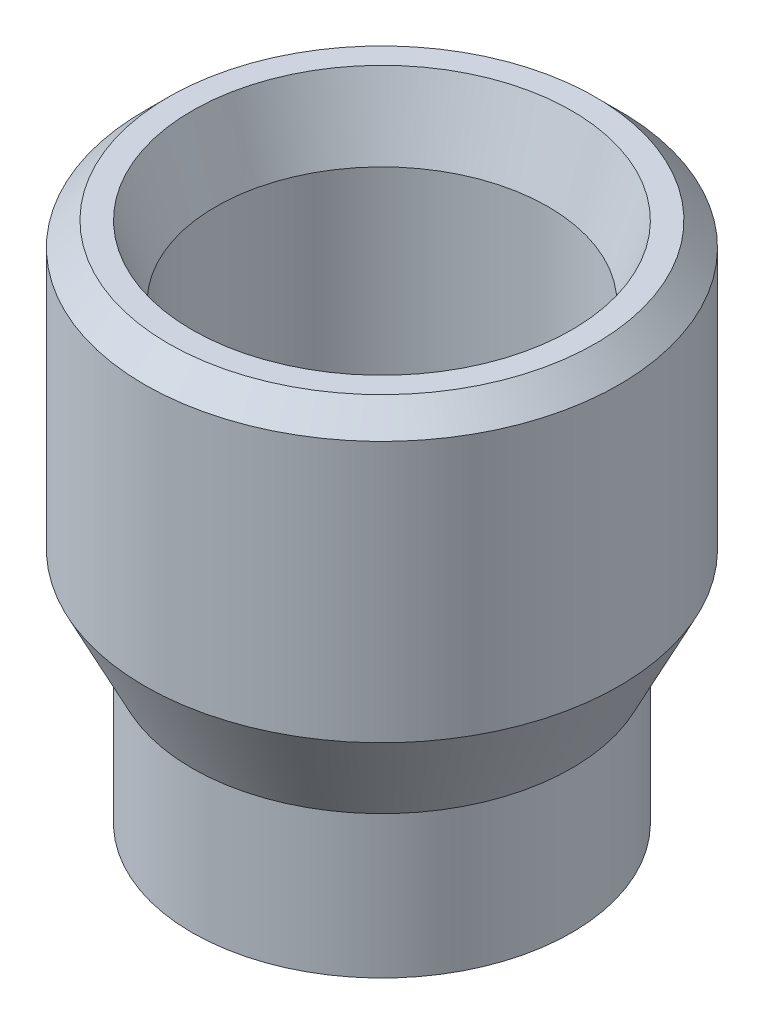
ISO-10303-21;
HEADER;
FILE_DESCRIPTION(('STEP AP214'),'2;1');
FILE_NAME('part.step','',(''),(''),'','','');
FILE_SCHEMA(('AUTOMOTIVE_DESIGN { 1 0 10303 214 1 1 1 1 }'));
ENDSEC;
DATA;
#1=APPLICATION_CONTEXT('core data for automotive mechanical design processes');
#2=APPLICATION_PROTOCOL_DEFINITION('international standard','automotive_design',2000,#1);
#3=PRODUCT_CONTEXT('',#1,'mechanical');
#4=PRODUCT('Part','Part','',(#3));
#5=PRODUCT_RELATED_PRODUCT_CATEGORY('part','',(#4));
#6=PRODUCT_DEFINITION_FORMATION('','',#4);
#7=PRODUCT_DEFINITION_CONTEXT('part definition',#1,'design');
#8=PRODUCT_DEFINITION('design','',#6,#7);
#9=PRODUCT_DEFINITION_SHAPE('','',#8);
#10=(LENGTH_UNIT() NAMED_UNIT(*) SI_UNIT(.MILLI.,.METRE.));
#11=(NAMED_UNIT(*) PLANE_ANGLE_UNIT() SI_UNIT($,.RADIAN.));
#12=(NAMED_UNIT(*) SI_UNIT($,.STERADIAN.) SOLID_ANGLE_UNIT());
#13=UNCERTAINTY_MEASURE_WITH_UNIT(LENGTH_MEASURE(1.E-05),#10,'distance_accuracy_value','');
#14=(GEOMETRIC_REPRESENTATION_CONTEXT(3) GLOBAL_UNCERTAINTY_ASSIGNED_CONTEXT((#13)) GLOBAL_UNIT_ASSIGNED_CONTEXT((#10,
#11,#12)) REPRESENTATION_CONTEXT('',''));
#15=CARTESIAN_POINT('',(0.,0.,0.));
#16=DIRECTION('',(0.,0.,1.));
#17=DIRECTION('',(1.,0.,0.));
#18=AXIS2_PLACEMENT_3D('',#15,#16,#17);
#19=CARTESIAN_POINT('',(0.,10.,0.));
#20=DIRECTION('',(0.,-1.,0.));
#21=DIRECTION('',(0.,0.,-1.));
#22=AXIS2_PLACEMENT_3D('',#19,#20,#21);
#23=CYLINDRICAL_SURFACE('',#22,8.);
#24=CARTESIAN_POINT('',(0.,6.00000000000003,0.));
#25=DIRECTION('',(0.,1.,0.));
#26=DIRECTION('',(0.,0.,1.));
#27=AXIS2_PLACEMENT_3D('',#24,#25,#26);
#28=CIRCLE('',#27,8.);
#29=CARTESIAN_POINT('',(0.,6.00000000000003,8.));
#30=VERTEX_POINT('',#29);
#31=EDGE_CURVE('E53',#30,#30,#28,.F.);
#32=ORIENTED_EDGE('',*,*,#31,.T.);
#33=EDGE_LOOP('',(#32));
#34=FACE_BOUND('',#33,.T.);
#35=CARTESIAN_POINT('',(0.,0.,0.));
#36=DIRECTION('',(0.,1.,0.));
#37=DIRECTION('',(0.,0.,1.));
#38=AXIS2_PLACEMENT_3D('',#35,#36,#37);
#39=CIRCLE('',#38,8.);
#40=CARTESIAN_POINT('',(0.,0.,8.));
#41=VERTEX_POINT('',#40);
#42=EDGE_CURVE('E56',#41,#41,#39,.T.);
#43=ORIENTED_EDGE('',*,*,#42,.T.);
#44=EDGE_LOOP('',(#43));
#45=FACE_BOUND('',#44,.T.);
#46=ADVANCED_FACE('F33',(#34,#45),#23,.T.);
#47=CARTESIAN_POINT('',(0.,0.,0.));
#48=DIRECTION('',(0.,1.,0.));
#49=DIRECTION('',(0.,0.,1.));
#50=AXIS2_PLACEMENT_3D('',#47,#48,#49);
#51=PLANE('',#50);
#52=CARTESIAN_POINT('',(0.,0.,0.));
#53=DIRECTION('',(0.,-1.,0.));
#54=DIRECTION('',(0.,0.,-1.));
#55=AXIS2_PLACEMENT_3D('',#52,#53,#54);
#56=CIRCLE('',#55,3.5);
#57=CARTESIAN_POINT('',(0.,0.,-3.5));
#58=VERTEX_POINT('',#57);
#59=EDGE_CURVE('E62',#58,#58,#56,.T.);
#60=ORIENTED_EDGE('',*,*,#59,.F.);
#61=EDGE_LOOP('',(#60));
#62=FACE_BOUND('',#61,.T.);
#63=ORIENTED_EDGE('',*,*,#42,.F.);
#64=EDGE_LOOP('',(#63));
#65=FACE_BOUND('',#64,.T.);
#66=ADVANCED_FACE('F87',(#62,#65),#51,.F.);
#67=CARTESIAN_POINT('',(0.,22.,0.));
#68=DIRECTION('',(0.,-1.,0.));
#69=DIRECTION('',(0.,0.,-1.));
#70=AXIS2_PLACEMENT_3D('',#67,#68,#69);
#71=CYLINDRICAL_SURFACE('',#70,10.);
#72=CARTESIAN_POINT('',(0.,21.,0.));
#73=DIRECTION('',(0.,1.,0.));
#74=DIRECTION('',(0.,0.,1.));
#75=AXIS2_PLACEMENT_3D('',#72,#73,#74);
#76=CIRCLE('',#75,10.);
#77=CARTESIAN_POINT('',(0.,21.,10.));
#78=VERTEX_POINT('',#77);
#79=EDGE_CURVE('E44',#78,#78,#76,.F.);
#80=ORIENTED_EDGE('',*,*,#79,.T.);
#81=EDGE_LOOP('',(#80));
#82=FACE_BOUND('',#81,.T.);
#83=CARTESIAN_POINT('',(0.,10.,0.));
#84=DIRECTION('',(0.,1.,0.));
#85=DIRECTION('',(0.,0.,1.));
#86=AXIS2_PLACEMENT_3D('',#83,#84,#85);
#87=CIRCLE('',#86,10.);
#88=CARTESIAN_POINT('',(0.,10.,10.));
#89=VERTEX_POINT('',#88);
#90=EDGE_CURVE('E59',#89,#89,#87,.T.);
#91=ORIENTED_EDGE('',*,*,#90,.T.);
#92=EDGE_LOOP('',(#91));
#93=FACE_BOUND('',#92,.T.);
#94=ADVANCED_FACE('F93',(#82,#93),#71,.T.);
#95=CARTESIAN_POINT('',(0.,22.,0.));
#96=DIRECTION('',(0.,1.,0.));
#97=DIRECTION('',(0.,0.,1.));
#98=AXIS2_PLACEMENT_3D('',#95,#96,#97);
#99=PLANE('',#98);
#100=CARTESIAN_POINT('',(0.,22.,0.));
#101=DIRECTION('',(0.,1.,0.));
#102=DIRECTION('',(0.,0.,1.));
#103=AXIS2_PLACEMENT_3D('',#100,#101,#102);
#104=CIRCLE('',#103,8.00000000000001);
#105=CARTESIAN_POINT('',(0.,22.,8.00000000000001));
#106=VERTEX_POINT('',#105);
#107=EDGE_CURVE('E10',#106,#106,#104,.F.);
#108=ORIENTED_EDGE('',*,*,#107,.T.);
#109=EDGE_LOOP('',(#108));
#110=FACE_BOUND('',#109,.T.);
#111=CARTESIAN_POINT('',(0.,22.,0.));
#112=DIRECTION('',(0.,1.,0.));
#113=DIRECTION('',(0.,0.,1.));
#114=AXIS2_PLACEMENT_3D('',#111,#112,#113);
#115=CIRCLE('',#114,8.99999999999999);
#116=CARTESIAN_POINT('',(0.,22.,8.99999999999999));
#117=VERTEX_POINT('',#116);
#118=EDGE_CURVE('E48',#117,#117,#115,.T.);
#119=ORIENTED_EDGE('',*,*,#118,.T.);
#120=EDGE_LOOP('',(#119));
#121=FACE_BOUND('',#120,.T.);
#122=ADVANCED_FACE('F102',(#110,#121),#99,.T.);
#123=CARTESIAN_POINT('',(0.,10.,0.));
#124=DIRECTION('',(0.,1.,0.));
#125=DIRECTION('',(0.,0.,1.));
#126=AXIS2_PLACEMENT_3D('',#123,#124,#125);
#127=CONICAL_SURFACE('',#126,9.99999999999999,0.463647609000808);
#128=ORIENTED_EDGE('',*,*,#31,.F.);
#129=EDGE_LOOP('',(#128));
#130=FACE_BOUND('',#129,.T.);
#131=ORIENTED_EDGE('',*,*,#90,.F.);
#132=EDGE_LOOP('',(#131));
#133=FACE_BOUND('',#132,.T.);
#134=ADVANCED_FACE('F99',(#130,#133),#127,.T.);
#135=CARTESIAN_POINT('',(0.,22.,0.));
#136=DIRECTION('',(0.,-1.,0.));
#137=DIRECTION('',(0.,0.,-1.));
#138=AXIS2_PLACEMENT_3D('',#135,#136,#137);
#139=CONICAL_SURFACE('',#138,8.99999999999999,0.785398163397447);
#140=ORIENTED_EDGE('',*,*,#79,.F.);
#141=EDGE_LOOP('',(#140));
#142=FACE_BOUND('',#141,.T.);
#143=ORIENTED_EDGE('',*,*,#118,.F.);
#144=EDGE_LOOP('',(#143));
#145=FACE_BOUND('',#144,.T.);
#146=ADVANCED_FACE('F101',(#142,#145),#139,.T.);
#147=CARTESIAN_POINT('',(0.,11.,0.));
#148=DIRECTION('',(0.,-1.,0.));
#149=DIRECTION('',(0.,0.,-1.));
#150=AXIS2_PLACEMENT_3D('',#147,#148,#149);
#151=CYLINDRICAL_SURFACE('',#150,3.5);
#152=CARTESIAN_POINT('',(0.,11.,0.));
#153=DIRECTION('',(0.,1.,0.));
#154=DIRECTION('',(0.,0.,1.));
#155=AXIS2_PLACEMENT_3D('',#152,#153,#154);
#156=CIRCLE('',#155,3.5);
#157=CARTESIAN_POINT('',(0.,11.,3.5));
#158=VERTEX_POINT('',#157);
#159=EDGE_CURVE('E65',#158,#158,#156,.F.);
#160=ORIENTED_EDGE('',*,*,#159,.F.);
#161=EDGE_LOOP('',(#160));
#162=FACE_BOUND('',#161,.T.);
#163=ORIENTED_EDGE('',*,*,#59,.T.);
#164=EDGE_LOOP('',(#163));
#165=FACE_BOUND('',#164,.T.);
#166=ADVANCED_FACE('F83',(#162,#165),#151,.F.);
#167=CARTESIAN_POINT('',(0.,11.,0.));
#168=DIRECTION('',(0.,1.,0.));
#169=DIRECTION('',(0.,0.,1.));
#170=AXIS2_PLACEMENT_3D('',#167,#168,#169);
#171=PLANE('',#170);
#172=CARTESIAN_POINT('',(0.,11.,0.));
#173=DIRECTION('',(0.,1.,0.));
#174=DIRECTION('',(0.,0.,1.));
#175=AXIS2_PLACEMENT_3D('',#172,#173,#174);
#176=CIRCLE('',#175,7.);
#177=CARTESIAN_POINT('',(0.,11.,7.));
#178=VERTEX_POINT('',#177);
#179=EDGE_CURVE('E68',#178,#178,#176,.T.);
#180=ORIENTED_EDGE('',*,*,#179,.T.);
#181=EDGE_LOOP('',(#180));
#182=FACE_BOUND('',#181,.T.);
#183=ORIENTED_EDGE('',*,*,#159,.T.);
#184=EDGE_LOOP('',(#183));
#185=FACE_BOUND('',#184,.T.);
#186=ADVANCED_FACE('F72',(#182,#185),#171,.T.);
#187=CARTESIAN_POINT('',(0.,11.,0.));
#188=DIRECTION('',(0.,1.,0.));
#189=DIRECTION('',(0.,0.,1.));
#190=AXIS2_PLACEMENT_3D('',#187,#188,#189);
#191=CYLINDRICAL_SURFACE('',#190,7.);
#192=CARTESIAN_POINT('',(0.,18.9999999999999,0.));
#193=DIRECTION('',(0.,1.,0.));
#194=DIRECTION('',(0.,0.,1.));
#195=AXIS2_PLACEMENT_3D('',#192,#193,#194);
#196=CIRCLE('',#195,7.);
#197=CARTESIAN_POINT('',(0.,18.9999999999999,7.));
#198=VERTEX_POINT('',#197);
#199=EDGE_CURVE('E40',#198,#198,#196,.T.);
#200=ORIENTED_EDGE('',*,*,#199,.T.);
#201=EDGE_LOOP('',(#200));
#202=FACE_BOUND('',#201,.T.);
#203=ORIENTED_EDGE('',*,*,#179,.F.);
#204=EDGE_LOOP('',(#203));
#205=FACE_BOUND('',#204,.T.);
#206=ADVANCED_FACE('F75',(#202,#205),#191,.F.);
#207=CARTESIAN_POINT('',(0.,18.9999999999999,0.));
#208=DIRECTION('',(0.,1.,0.));
#209=DIRECTION('',(0.,0.,1.));
#210=AXIS2_PLACEMENT_3D('',#207,#208,#209);
#211=CONICAL_SURFACE('',#210,7.,0.321750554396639);
#212=ORIENTED_EDGE('',*,*,#107,.F.);
#213=EDGE_LOOP('',(#212));
#214=FACE_BOUND('',#213,.T.);
#215=ORIENTED_EDGE('',*,*,#199,.F.);
#216=EDGE_LOOP('',(#215));
#217=FACE_BOUND('',#216,.T.);
#218=ADVANCED_FACE('F35',(#214,#217),#211,.F.);
#219=CLOSED_SHELL('',(#46,#66,#94,#122,#134,#146,#166,#186,#206,#218));
#220=MANIFOLD_SOLID_BREP('B2',#219);
#221=ADVANCED_BREP_SHAPE_REPRESENTATION('',(#18,#220),#14);
#222=SHAPE_DEFINITION_REPRESENTATION(#9,#221);
ENDSEC;
END-ISO-10303-21;
